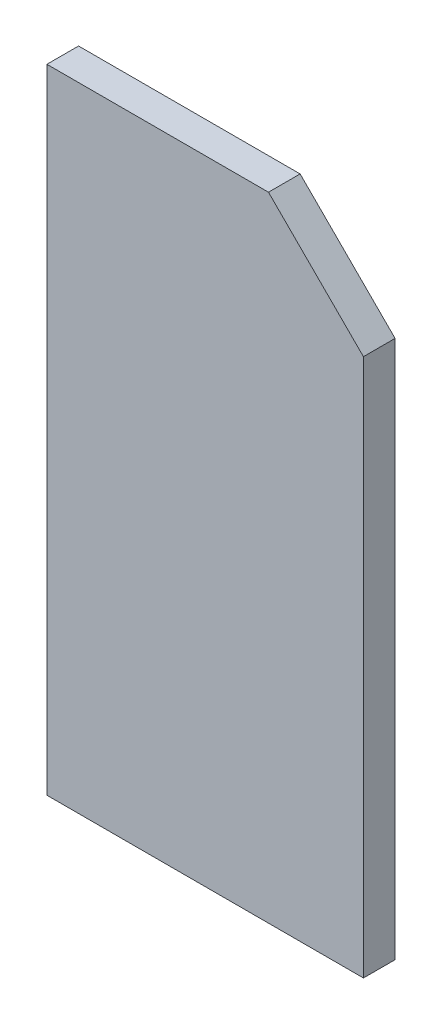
from build123d import *

# Parameters (mm, degrees)
SKETCH3_W           = 250
SKETCH3_H           = 500
BOSS_EXTRUDE2_DEPTH = 25
CUT_EXTRUDE1_DEPTH  = 25.4


with BuildPart() as part:
    # Sketch3 → Boss-Extrude2 (new body)
    with BuildSketch(Plane.XY):
        with Locations((125, 250)):
            Rectangle(SKETCH3_W, SKETCH3_H)
    extrude(amount=BOSS_EXTRUDE2_DEPTH)

    # Sketch4 → Cut-Extrude1 (cut)
    with BuildSketch(Plane.XY.offset(25)):
        Polygon((175, 500), (250, 425), (250, 500), align=None)
    extrude(amount=-CUT_EXTRUDE1_DEPTH, mode=Mode.SUBTRACT)


solid = part.part
